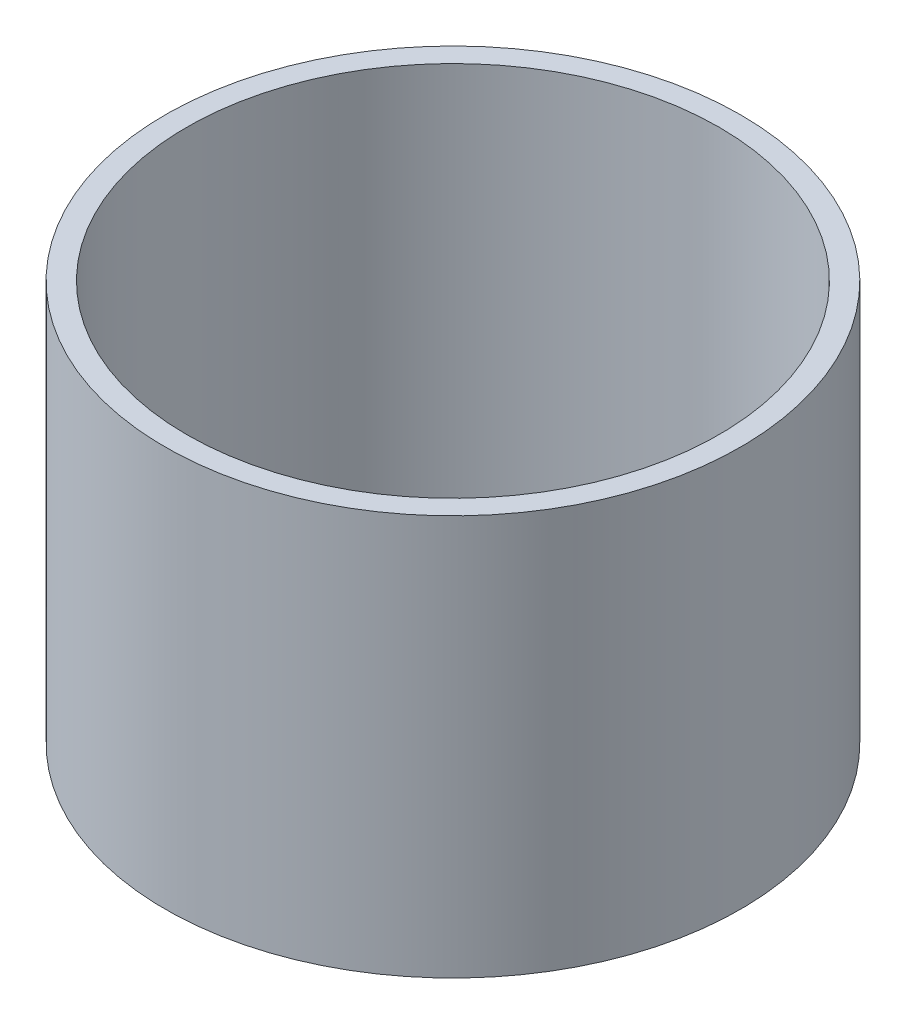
ISO-10303-21;
HEADER;
FILE_DESCRIPTION(('STEP AP214'),'2;1');
FILE_NAME('part.step','',(''),(''),'','','');
FILE_SCHEMA(('AUTOMOTIVE_DESIGN { 1 0 10303 214 1 1 1 1 }'));
ENDSEC;
DATA;
#1=APPLICATION_CONTEXT('core data for automotive mechanical design processes');
#2=APPLICATION_PROTOCOL_DEFINITION('international standard','automotive_design',2000,#1);
#3=PRODUCT_CONTEXT('',#1,'mechanical');
#4=PRODUCT('Part','Part','',(#3));
#5=PRODUCT_RELATED_PRODUCT_CATEGORY('part','',(#4));
#6=PRODUCT_DEFINITION_FORMATION('','',#4);
#7=PRODUCT_DEFINITION_CONTEXT('part definition',#1,'design');
#8=PRODUCT_DEFINITION('design','',#6,#7);
#9=PRODUCT_DEFINITION_SHAPE('','',#8);
#10=(LENGTH_UNIT() NAMED_UNIT(*) SI_UNIT(.MILLI.,.METRE.));
#11=(NAMED_UNIT(*) PLANE_ANGLE_UNIT() SI_UNIT($,.RADIAN.));
#12=(NAMED_UNIT(*) SI_UNIT($,.STERADIAN.) SOLID_ANGLE_UNIT());
#13=UNCERTAINTY_MEASURE_WITH_UNIT(LENGTH_MEASURE(1.E-05),#10,'distance_accuracy_value','');
#14=(GEOMETRIC_REPRESENTATION_CONTEXT(3) GLOBAL_UNCERTAINTY_ASSIGNED_CONTEXT((#13)) GLOBAL_UNIT_ASSIGNED_CONTEXT((#10,
#11,#12)) REPRESENTATION_CONTEXT('',''));
#15=CARTESIAN_POINT('',(0.,0.,0.));
#16=DIRECTION('',(0.,0.,1.));
#17=DIRECTION('',(1.,0.,0.));
#18=AXIS2_PLACEMENT_3D('',#15,#16,#17);
#19=CARTESIAN_POINT('',(0.,152.4,0.));
#20=DIRECTION('',(0.,1.,0.));
#21=DIRECTION('',(0.,0.,1.));
#22=AXIS2_PLACEMENT_3D('',#19,#20,#21);
#23=PLANE('',#22);
#24=CARTESIAN_POINT('',(0.,152.4,0.));
#25=DIRECTION('',(0.,1.,0.));
#26=DIRECTION('',(0.,0.,1.));
#27=AXIS2_PLACEMENT_3D('',#24,#25,#26);
#28=CIRCLE('',#27,109.5375);
#29=CARTESIAN_POINT('',(0.,152.4,-109.5375));
#30=VERTEX_POINT('',#29);
#31=EDGE_CURVE('E10',#30,#30,#28,.T.);
#32=ORIENTED_EDGE('',*,*,#31,.T.);
#33=EDGE_LOOP('',(#32));
#34=FACE_BOUND('',#33,.T.);
#35=CARTESIAN_POINT('',(0.,152.4,0.));
#36=DIRECTION('',(0.,1.,0.));
#37=DIRECTION('',(0.,0.,1.));
#38=AXIS2_PLACEMENT_3D('',#35,#36,#37);
#39=CIRCLE('',#38,101.3587);
#40=CARTESIAN_POINT('',(0.,152.4,-101.3587));
#41=VERTEX_POINT('',#40);
#42=EDGE_CURVE('E50',#41,#41,#39,.T.);
#43=ORIENTED_EDGE('',*,*,#42,.F.);
#44=EDGE_LOOP('',(#43));
#45=FACE_BOUND('',#44,.T.);
#46=ADVANCED_FACE('F35',(#34,#45),#23,.T.);
#47=CARTESIAN_POINT('',(0.,0.,0.));
#48=DIRECTION('',(0.,1.,0.));
#49=DIRECTION('',(0.,0.,1.));
#50=AXIS2_PLACEMENT_3D('',#47,#48,#49);
#51=PLANE('',#50);
#52=CARTESIAN_POINT('',(0.,0.,0.));
#53=DIRECTION('',(0.,1.,0.));
#54=DIRECTION('',(0.,0.,1.));
#55=AXIS2_PLACEMENT_3D('',#52,#53,#54);
#56=CIRCLE('',#55,109.5375);
#57=CARTESIAN_POINT('',(0.,0.,-109.5375));
#58=VERTEX_POINT('',#57);
#59=EDGE_CURVE('E39',#58,#58,#56,.T.);
#60=ORIENTED_EDGE('',*,*,#59,.F.);
#61=EDGE_LOOP('',(#60));
#62=FACE_BOUND('',#61,.T.);
#63=CARTESIAN_POINT('',(0.,0.,0.));
#64=DIRECTION('',(0.,1.,0.));
#65=DIRECTION('',(0.,0.,1.));
#66=AXIS2_PLACEMENT_3D('',#63,#64,#65);
#67=CIRCLE('',#66,101.3587);
#68=CARTESIAN_POINT('',(0.,0.,-101.3587));
#69=VERTEX_POINT('',#68);
#70=EDGE_CURVE('E52',#69,#69,#67,.T.);
#71=ORIENTED_EDGE('',*,*,#70,.T.);
#72=EDGE_LOOP('',(#71));
#73=FACE_BOUND('',#72,.T.);
#74=ADVANCED_FACE('F62',(#62,#73),#51,.F.);
#75=CARTESIAN_POINT('',(0.,152.4,0.));
#76=DIRECTION('',(0.,-1.,0.));
#77=DIRECTION('',(0.,0.,-1.));
#78=AXIS2_PLACEMENT_3D('',#75,#76,#77);
#79=CYLINDRICAL_SURFACE('',#78,109.5375);
#80=CARTESIAN_POINT('',(0.,152.4,-109.5375));
#81=CARTESIAN_POINT('',(0.,150.8125,-109.5375));
#82=CARTESIAN_POINT('',(0.,149.225,-109.5375));
#83=CARTESIAN_POINT('',(0.,146.05,-109.5375));
#84=CARTESIAN_POINT('',(0.,144.4625,-109.5375));
#85=CARTESIAN_POINT('',(0.,141.2875,-109.5375));
#86=CARTESIAN_POINT('',(0.,139.7,-109.5375));
#87=CARTESIAN_POINT('',(0.,136.525,-109.5375));
#88=CARTESIAN_POINT('',(0.,134.9375,-109.5375));
#89=CARTESIAN_POINT('',(0.,131.7625,-109.5375));
#90=CARTESIAN_POINT('',(0.,130.175,-109.5375));
#91=CARTESIAN_POINT('',(0.,127.,-109.5375));
#92=CARTESIAN_POINT('',(0.,125.4125,-109.5375));
#93=CARTESIAN_POINT('',(0.,122.2375,-109.5375));
#94=CARTESIAN_POINT('',(0.,120.65,-109.5375));
#95=CARTESIAN_POINT('',(0.,117.475,-109.5375));
#96=CARTESIAN_POINT('',(0.,115.8875,-109.5375));
#97=CARTESIAN_POINT('',(0.,112.7125,-109.5375));
#98=CARTESIAN_POINT('',(0.,111.125,-109.5375));
#99=CARTESIAN_POINT('',(0.,107.95,-109.5375));
#100=CARTESIAN_POINT('',(0.,106.3625,-109.5375));
#101=CARTESIAN_POINT('',(0.,103.1875,-109.5375));
#102=CARTESIAN_POINT('',(0.,101.6,-109.5375));
#103=CARTESIAN_POINT('',(0.,98.425,-109.5375));
#104=CARTESIAN_POINT('',(0.,96.8375,-109.5375));
#105=CARTESIAN_POINT('',(0.,93.6625,-109.5375));
#106=CARTESIAN_POINT('',(0.,92.075,-109.5375));
#107=CARTESIAN_POINT('',(0.,88.9,-109.5375));
#108=CARTESIAN_POINT('',(0.,87.3125,-109.5375));
#109=CARTESIAN_POINT('',(0.,84.1375,-109.5375));
#110=CARTESIAN_POINT('',(0.,82.55,-109.5375));
#111=CARTESIAN_POINT('',(0.,79.375,-109.5375));
#112=CARTESIAN_POINT('',(0.,77.7875,-109.5375));
#113=CARTESIAN_POINT('',(0.,74.6125,-109.5375));
#114=CARTESIAN_POINT('',(0.,73.025,-109.5375));
#115=CARTESIAN_POINT('',(0.,69.85,-109.5375));
#116=CARTESIAN_POINT('',(0.,68.2625,-109.5375));
#117=CARTESIAN_POINT('',(0.,65.0875,-109.5375));
#118=CARTESIAN_POINT('',(0.,63.5,-109.5375));
#119=CARTESIAN_POINT('',(0.,60.325,-109.5375));
#120=CARTESIAN_POINT('',(0.,58.7375,-109.5375));
#121=CARTESIAN_POINT('',(0.,55.5625,-109.5375));
#122=CARTESIAN_POINT('',(0.,53.975,-109.5375));
#123=CARTESIAN_POINT('',(0.,50.8,-109.5375));
#124=CARTESIAN_POINT('',(0.,49.2125,-109.5375));
#125=CARTESIAN_POINT('',(0.,46.0375,-109.5375));
#126=CARTESIAN_POINT('',(0.,44.45,-109.5375));
#127=CARTESIAN_POINT('',(0.,41.275,-109.5375));
#128=CARTESIAN_POINT('',(0.,39.6875,-109.5375));
#129=CARTESIAN_POINT('',(0.,36.5125,-109.5375));
#130=CARTESIAN_POINT('',(0.,34.925,-109.5375));
#131=CARTESIAN_POINT('',(0.,31.75,-109.5375));
#132=CARTESIAN_POINT('',(0.,30.1625,-109.5375));
#133=CARTESIAN_POINT('',(0.,26.9875,-109.5375));
#134=CARTESIAN_POINT('',(0.,25.4,-109.5375));
#135=CARTESIAN_POINT('',(0.,22.225,-109.5375));
#136=CARTESIAN_POINT('',(0.,20.6375,-109.5375));
#137=CARTESIAN_POINT('',(0.,17.4625,-109.5375));
#138=CARTESIAN_POINT('',(0.,15.875,-109.5375));
#139=CARTESIAN_POINT('',(0.,12.7,-109.5375));
#140=CARTESIAN_POINT('',(0.,11.1125,-109.5375));
#141=CARTESIAN_POINT('',(0.,7.93750000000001,-109.5375));
#142=CARTESIAN_POINT('',(0.,6.35,-109.5375));
#143=CARTESIAN_POINT('',(0.,3.175,-109.5375));
#144=CARTESIAN_POINT('',(0.,1.5875,-109.5375));
#145=CARTESIAN_POINT('',(0.,0.,-109.5375));
#146=B_SPLINE_CURVE_WITH_KNOTS('',3,(#80,#81,#82,#83,#84,#85,#86,#87,#88,#89,#90,#91,#92,#93,
#94,#95,#96,#97,#98,#99,#100,#101,#102,#103,#104,#105,#106,#107,#108,#109,#110,#111,#112,#113,
#114,#115,#116,#117,#118,#119,#120,#121,#122,#123,#124,#125,#126,#127,#128,#129,#130,#131,#132,
#133,#134,#135,#136,#137,#138,#139,#140,#141,#142,#143,#144,#145),.UNSPECIFIED.,.F.,.F.,(4,2,2,
2,2,2,2,2,2,2,2,2,2,2,2,2,2,2,2,2,2,2,2,2,2,2,2,2,2,2,2,2,4),(0.,4.76249999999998,
9.52499999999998,14.2875,19.05,23.8125,28.575,33.3375,38.1,42.8625,47.625,52.3875,57.15,61.9125,
66.675,71.4375,76.2,80.9625,85.725,90.4875,95.25,100.0125,104.775,109.5375,114.3,119.0625,
123.825,128.5875,133.35,138.1125,142.875,147.6375,152.4),.UNSPECIFIED.);
#147=EDGE_CURVE('BSEAM37',#30,#58,#146,.T.);
#148=ORIENTED_EDGE('',*,*,#31,.F.);
#149=ORIENTED_EDGE('',*,*,#59,.T.);
#150=ORIENTED_EDGE('',*,*,#147,.T.);
#151=ORIENTED_EDGE('',*,*,#147,.F.);
#152=EDGE_LOOP('',(#148,#150,#149,#151));
#153=FACE_BOUND('',#152,.T.);
#154=ADVANCED_FACE('F37',(#153),#79,.T.);
#155=CARTESIAN_POINT('',(0.,152.4,0.));
#156=DIRECTION('',(0.,-1.,0.));
#157=DIRECTION('',(0.,0.,-1.));
#158=AXIS2_PLACEMENT_3D('',#155,#156,#157);
#159=CYLINDRICAL_SURFACE('',#158,101.3587);
#160=CARTESIAN_POINT('',(0.,152.4,-101.3587));
#161=CARTESIAN_POINT('',(0.,150.8125,-101.3587));
#162=CARTESIAN_POINT('',(0.,149.225,-101.3587));
#163=CARTESIAN_POINT('',(0.,146.05,-101.3587));
#164=CARTESIAN_POINT('',(0.,144.4625,-101.3587));
#165=CARTESIAN_POINT('',(0.,141.2875,-101.3587));
#166=CARTESIAN_POINT('',(0.,139.7,-101.3587));
#167=CARTESIAN_POINT('',(0.,136.525,-101.3587));
#168=CARTESIAN_POINT('',(0.,134.9375,-101.3587));
#169=CARTESIAN_POINT('',(0.,131.7625,-101.3587));
#170=CARTESIAN_POINT('',(0.,130.175,-101.3587));
#171=CARTESIAN_POINT('',(0.,127.,-101.3587));
#172=CARTESIAN_POINT('',(0.,125.4125,-101.3587));
#173=CARTESIAN_POINT('',(0.,122.2375,-101.3587));
#174=CARTESIAN_POINT('',(0.,120.65,-101.3587));
#175=CARTESIAN_POINT('',(0.,117.475,-101.3587));
#176=CARTESIAN_POINT('',(0.,115.8875,-101.3587));
#177=CARTESIAN_POINT('',(0.,112.7125,-101.3587));
#178=CARTESIAN_POINT('',(0.,111.125,-101.3587));
#179=CARTESIAN_POINT('',(0.,107.95,-101.3587));
#180=CARTESIAN_POINT('',(0.,106.3625,-101.3587));
#181=CARTESIAN_POINT('',(0.,103.1875,-101.3587));
#182=CARTESIAN_POINT('',(0.,101.6,-101.3587));
#183=CARTESIAN_POINT('',(0.,98.425,-101.3587));
#184=CARTESIAN_POINT('',(0.,96.8375,-101.3587));
#185=CARTESIAN_POINT('',(0.,93.6625,-101.3587));
#186=CARTESIAN_POINT('',(0.,92.075,-101.3587));
#187=CARTESIAN_POINT('',(0.,88.9,-101.3587));
#188=CARTESIAN_POINT('',(0.,87.3125,-101.3587));
#189=CARTESIAN_POINT('',(0.,84.1375,-101.3587));
#190=CARTESIAN_POINT('',(0.,82.55,-101.3587));
#191=CARTESIAN_POINT('',(0.,79.375,-101.3587));
#192=CARTESIAN_POINT('',(0.,77.7875,-101.3587));
#193=CARTESIAN_POINT('',(0.,74.6125,-101.3587));
#194=CARTESIAN_POINT('',(0.,73.025,-101.3587));
#195=CARTESIAN_POINT('',(0.,69.85,-101.3587));
#196=CARTESIAN_POINT('',(0.,68.2625,-101.3587));
#197=CARTESIAN_POINT('',(0.,65.0875,-101.3587));
#198=CARTESIAN_POINT('',(0.,63.5,-101.3587));
#199=CARTESIAN_POINT('',(0.,60.325,-101.3587));
#200=CARTESIAN_POINT('',(0.,58.7375,-101.3587));
#201=CARTESIAN_POINT('',(0.,55.5625,-101.3587));
#202=CARTESIAN_POINT('',(0.,53.975,-101.3587));
#203=CARTESIAN_POINT('',(0.,50.8,-101.3587));
#204=CARTESIAN_POINT('',(0.,49.2125,-101.3587));
#205=CARTESIAN_POINT('',(0.,46.0375,-101.3587));
#206=CARTESIAN_POINT('',(0.,44.45,-101.3587));
#207=CARTESIAN_POINT('',(0.,41.275,-101.3587));
#208=CARTESIAN_POINT('',(0.,39.6875,-101.3587));
#209=CARTESIAN_POINT('',(0.,36.5125,-101.3587));
#210=CARTESIAN_POINT('',(0.,34.925,-101.3587));
#211=CARTESIAN_POINT('',(0.,31.75,-101.3587));
#212=CARTESIAN_POINT('',(0.,30.1625,-101.3587));
#213=CARTESIAN_POINT('',(0.,26.9875,-101.3587));
#214=CARTESIAN_POINT('',(0.,25.4,-101.3587));
#215=CARTESIAN_POINT('',(0.,22.225,-101.3587));
#216=CARTESIAN_POINT('',(0.,20.6375,-101.3587));
#217=CARTESIAN_POINT('',(0.,17.4625,-101.3587));
#218=CARTESIAN_POINT('',(0.,15.875,-101.3587));
#219=CARTESIAN_POINT('',(0.,12.7,-101.3587));
#220=CARTESIAN_POINT('',(0.,11.1125,-101.3587));
#221=CARTESIAN_POINT('',(0.,7.93750000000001,-101.3587));
#222=CARTESIAN_POINT('',(0.,6.35,-101.3587));
#223=CARTESIAN_POINT('',(0.,3.175,-101.3587));
#224=CARTESIAN_POINT('',(0.,1.5875,-101.3587));
#225=CARTESIAN_POINT('',(0.,0.,-101.3587));
#226=B_SPLINE_CURVE_WITH_KNOTS('',3,(#160,#161,#162,#163,#164,#165,#166,#167,#168,#169,#170,
#171,#172,#173,#174,#175,#176,#177,#178,#179,#180,#181,#182,#183,#184,#185,#186,#187,#188,#189,
#190,#191,#192,#193,#194,#195,#196,#197,#198,#199,#200,#201,#202,#203,#204,#205,#206,#207,#208,
#209,#210,#211,#212,#213,#214,#215,#216,#217,#218,#219,#220,#221,#222,#223,#224,#225),
.UNSPECIFIED.,.F.,.F.,(4,2,2,2,2,2,2,2,2,2,2,2,2,2,2,2,2,2,2,2,2,2,2,2,2,2,2,2,2,2,2,2,4),(0.,
4.7625,9.52500000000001,14.2875,19.05,23.8125,28.575,33.3375,38.1,42.8625,47.625,52.3875,57.15,
61.9125,66.675,71.4375,76.2,80.9625,85.725,90.4875,95.25,100.0125,104.775,109.5375,114.3,
119.0625,123.825,128.5875,133.35,138.1125,142.875,147.6375,152.4),.UNSPECIFIED.);
#227=EDGE_CURVE('BSEAM58',#41,#69,#226,.T.);
#228=ORIENTED_EDGE('',*,*,#42,.T.);
#229=ORIENTED_EDGE('',*,*,#70,.F.);
#230=ORIENTED_EDGE('',*,*,#227,.T.);
#231=ORIENTED_EDGE('',*,*,#227,.F.);
#232=EDGE_LOOP('',(#228,#230,#229,#231));
#233=FACE_BOUND('',#232,.T.);
#234=ADVANCED_FACE('F58',(#233),#159,.F.);
#235=CLOSED_SHELL('',(#46,#74,#154,#234));
#236=MANIFOLD_SOLID_BREP('B2',#235);
#237=ADVANCED_BREP_SHAPE_REPRESENTATION('',(#18,#236),#14);
#238=SHAPE_DEFINITION_REPRESENTATION(#9,#237);
ENDSEC;
END-ISO-10303-21;
